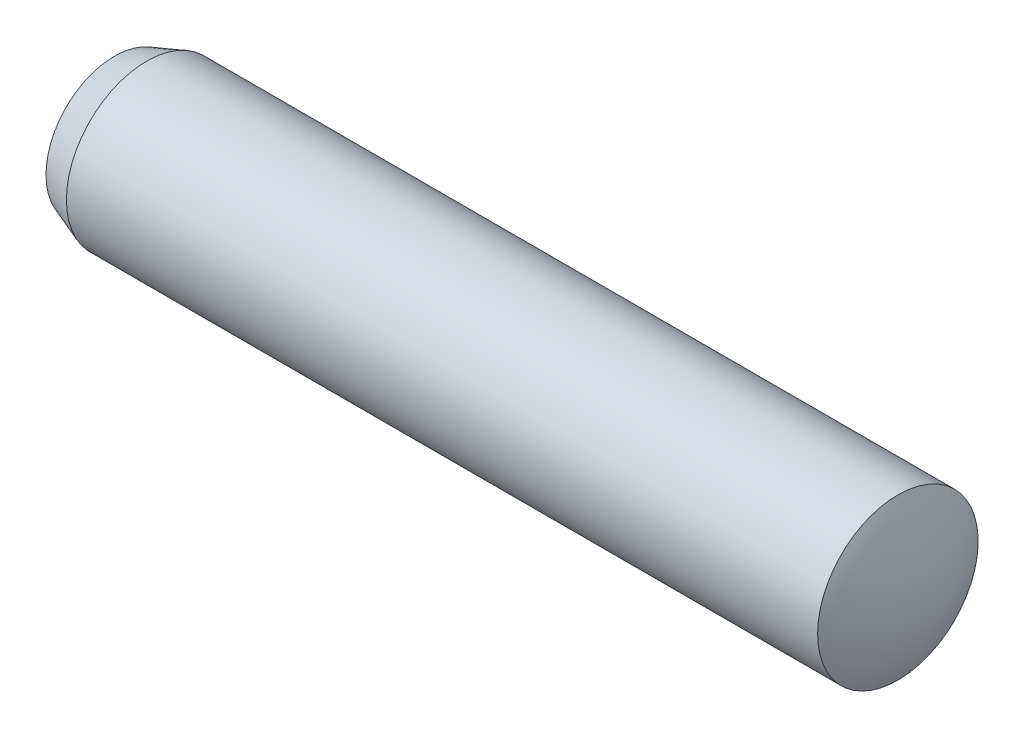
ISO-10303-21;
HEADER;
FILE_DESCRIPTION(('STEP AP214'),'2;1');
FILE_NAME('part.step','',(''),(''),'','','');
FILE_SCHEMA(('AUTOMOTIVE_DESIGN { 1 0 10303 214 1 1 1 1 }'));
ENDSEC;
DATA;
#1=APPLICATION_CONTEXT('core data for automotive mechanical design processes');
#2=APPLICATION_PROTOCOL_DEFINITION('international standard','automotive_design',2000,#1);
#3=PRODUCT_CONTEXT('',#1,'mechanical');
#4=PRODUCT('Part','Part','',(#3));
#5=PRODUCT_RELATED_PRODUCT_CATEGORY('part','',(#4));
#6=PRODUCT_DEFINITION_FORMATION('','',#4);
#7=PRODUCT_DEFINITION_CONTEXT('part definition',#1,'design');
#8=PRODUCT_DEFINITION('design','',#6,#7);
#9=PRODUCT_DEFINITION_SHAPE('','',#8);
#10=(LENGTH_UNIT() NAMED_UNIT(*) SI_UNIT(.MILLI.,.METRE.));
#11=(NAMED_UNIT(*) PLANE_ANGLE_UNIT() SI_UNIT($,.RADIAN.));
#12=(NAMED_UNIT(*) SI_UNIT($,.STERADIAN.) SOLID_ANGLE_UNIT());
#13=UNCERTAINTY_MEASURE_WITH_UNIT(LENGTH_MEASURE(1.E-05),#10,'distance_accuracy_value','');
#14=(GEOMETRIC_REPRESENTATION_CONTEXT(3) GLOBAL_UNCERTAINTY_ASSIGNED_CONTEXT((#13)) GLOBAL_UNIT_ASSIGNED_CONTEXT((#10,
#11,#12)) REPRESENTATION_CONTEXT('',''));
#15=CARTESIAN_POINT('',(0.,0.,0.));
#16=DIRECTION('',(0.,0.,1.));
#17=DIRECTION('',(1.,0.,0.));
#18=AXIS2_PLACEMENT_3D('',#15,#16,#17);
#19=CARTESIAN_POINT('',(0.,0.,0.));
#20=DIRECTION('',(-1.,0.,0.));
#21=DIRECTION('',(0.,0.,1.));
#22=AXIS2_PLACEMENT_3D('',#19,#20,#21);
#23=PLANE('',#22);
#24=CARTESIAN_POINT('',(0.,0.,0.));
#25=DIRECTION('',(-1.,0.,0.));
#26=DIRECTION('',(0.,0.,1.));
#27=AXIS2_PLACEMENT_3D('',#24,#25,#26);
#28=CIRCLE('',#27,4.27205953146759);
#29=CARTESIAN_POINT('',(0.,0.,4.27205953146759));
#30=VERTEX_POINT('',#29);
#31=EDGE_CURVE('E10',#30,#30,#28,.T.);
#32=ORIENTED_EDGE('',*,*,#31,.T.);
#33=EDGE_LOOP('',(#32));
#34=FACE_BOUND('',#33,.T.);
#35=ADVANCED_FACE('F27',(#34),#23,.T.);
#36=CARTESIAN_POINT('',(0.,0.,0.));
#37=DIRECTION('',(1.,0.,0.));
#38=DIRECTION('',(0.,0.,-1.));
#39=AXIS2_PLACEMENT_3D('',#36,#37,#38);
#40=CONICAL_SURFACE('',#39,4.27205953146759,0.349065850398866);
#41=CARTESIAN_POINT('',(2.,0.,0.));
#42=DIRECTION('',(-1.,0.,0.));
#43=DIRECTION('',(0.,0.,1.));
#44=AXIS2_PLACEMENT_3D('',#41,#42,#43);
#45=CIRCLE('',#44,5.);
#46=CARTESIAN_POINT('',(2.,0.,5.));
#47=VERTEX_POINT('',#46);
#48=EDGE_CURVE('E33',#47,#47,#45,.T.);
#49=ORIENTED_EDGE('',*,*,#48,.T.);
#50=EDGE_LOOP('',(#49));
#51=FACE_BOUND('',#50,.T.);
#52=ORIENTED_EDGE('',*,*,#31,.F.);
#53=EDGE_LOOP('',(#52));
#54=FACE_BOUND('',#53,.T.);
#55=ADVANCED_FACE('F53',(#51,#54),#40,.T.);
#56=CARTESIAN_POINT('',(0.,0.,0.));
#57=DIRECTION('',(-1.,0.,0.));
#58=DIRECTION('',(0.,0.,1.));
#59=AXIS2_PLACEMENT_3D('',#56,#57,#58);
#60=CYLINDRICAL_SURFACE('',#59,5.);
#61=CARTESIAN_POINT('',(48.8,0.,-1.11022302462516E-13));
#62=DIRECTION('',(-1.,0.,0.));
#63=DIRECTION('',(0.,0.,1.));
#64=AXIS2_PLACEMENT_3D('',#61,#62,#63);
#65=CIRCLE('',#64,5.);
#66=CARTESIAN_POINT('',(48.8,0.,4.99999999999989));
#67=VERTEX_POINT('',#66);
#68=EDGE_CURVE('E37',#67,#67,#65,.T.);
#69=ORIENTED_EDGE('',*,*,#68,.T.);
#70=EDGE_LOOP('',(#69));
#71=FACE_BOUND('',#70,.T.);
#72=ORIENTED_EDGE('',*,*,#48,.F.);
#73=EDGE_LOOP('',(#72));
#74=FACE_BOUND('',#73,.T.);
#75=ADVANCED_FACE('F44',(#71,#74),#60,.T.);
#76=CARTESIAN_POINT('',(38.9833333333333,0.,-1.11022302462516E-13));
#77=DIRECTION('',(0.,0.,1.));
#78=DIRECTION('',(1.,0.,0.));
#79=AXIS2_PLACEMENT_3D('',#76,#77,#78);
#80=SPHERICAL_SURFACE('',#79,11.0166666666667);
#81=CARTESIAN_POINT('',(38.9833333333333,0.,-1.11022302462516E-13));
#82=DIRECTION('',(-1.,0.,0.));
#83=DIRECTION('',(0.,0.,1.));
#84=AXIS2_PLACEMENT_3D('',#81,#82,#83);
#85=SPHERICAL_SURFACE('',#84,11.0166666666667);
#86=ORIENTED_EDGE('',*,*,#68,.F.);
#87=EDGE_LOOP('',(#86));
#88=FACE_BOUND('',#87,.T.);
#89=ADVANCED_FACE('F47',(#88),#85,.T.);
#90=CLOSED_SHELL('',(#35,#55,#75,#89));
#91=MANIFOLD_SOLID_BREP('B2',#90);
#92=ADVANCED_BREP_SHAPE_REPRESENTATION('',(#18,#91),#14);
#93=SHAPE_DEFINITION_REPRESENTATION(#9,#92);
ENDSEC;
END-ISO-10303-21;
